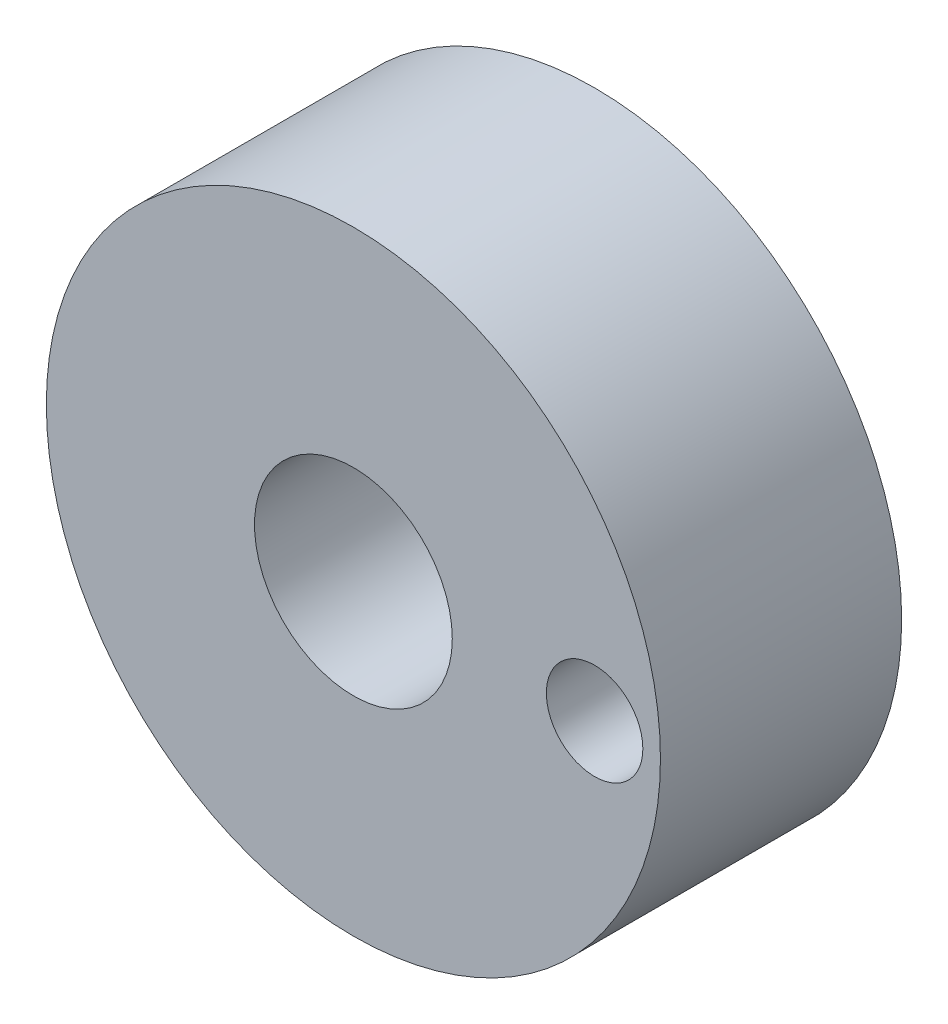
ISO-10303-21;
HEADER;
FILE_DESCRIPTION(('STEP AP214'),'2;1');
FILE_NAME('part.step','',(''),(''),'','','');
FILE_SCHEMA(('AUTOMOTIVE_DESIGN { 1 0 10303 214 1 1 1 1 }'));
ENDSEC;
DATA;
#1=APPLICATION_CONTEXT('core data for automotive mechanical design processes');
#2=APPLICATION_PROTOCOL_DEFINITION('international standard','automotive_design',2000,#1);
#3=PRODUCT_CONTEXT('',#1,'mechanical');
#4=PRODUCT('Part','Part','',(#3));
#5=PRODUCT_RELATED_PRODUCT_CATEGORY('part','',(#4));
#6=PRODUCT_DEFINITION_FORMATION('','',#4);
#7=PRODUCT_DEFINITION_CONTEXT('part definition',#1,'design');
#8=PRODUCT_DEFINITION('design','',#6,#7);
#9=PRODUCT_DEFINITION_SHAPE('','',#8);
#10=(LENGTH_UNIT() NAMED_UNIT(*) SI_UNIT(.MILLI.,.METRE.));
#11=(NAMED_UNIT(*) PLANE_ANGLE_UNIT() SI_UNIT($,.RADIAN.));
#12=(NAMED_UNIT(*) SI_UNIT($,.STERADIAN.) SOLID_ANGLE_UNIT());
#13=UNCERTAINTY_MEASURE_WITH_UNIT(LENGTH_MEASURE(1.E-05),#10,'distance_accuracy_value','');
#14=(GEOMETRIC_REPRESENTATION_CONTEXT(3) GLOBAL_UNCERTAINTY_ASSIGNED_CONTEXT((#13)) GLOBAL_UNIT_ASSIGNED_CONTEXT((#10,
#11,#12)) REPRESENTATION_CONTEXT('',''));
#15=CARTESIAN_POINT('',(0.,0.,0.));
#16=DIRECTION('',(0.,0.,1.));
#17=DIRECTION('',(1.,0.,0.));
#18=AXIS2_PLACEMENT_3D('',#15,#16,#17);
#19=CARTESIAN_POINT('',(0.,0.,5.));
#20=DIRECTION('',(0.,0.,-1.));
#21=DIRECTION('',(-1.,0.,0.));
#22=AXIS2_PLACEMENT_3D('',#19,#20,#21);
#23=CYLINDRICAL_SURFACE('',#22,6.365);
#24=CARTESIAN_POINT('',(0.,0.,5.));
#25=DIRECTION('',(0.,0.,1.));
#26=DIRECTION('',(1.,0.,0.));
#27=AXIS2_PLACEMENT_3D('',#24,#25,#26);
#28=CIRCLE('',#27,6.365);
#29=CARTESIAN_POINT('',(6.365,0.,5.));
#30=VERTEX_POINT('',#29);
#31=EDGE_CURVE('E10',#30,#30,#28,.T.);
#32=ORIENTED_EDGE('',*,*,#31,.F.);
#33=EDGE_LOOP('',(#32));
#34=FACE_BOUND('',#33,.T.);
#35=CARTESIAN_POINT('',(0.,0.,0.));
#36=DIRECTION('',(0.,0.,1.));
#37=DIRECTION('',(1.,0.,0.));
#38=AXIS2_PLACEMENT_3D('',#35,#36,#37);
#39=CIRCLE('',#38,6.365);
#40=CARTESIAN_POINT('',(6.365,0.,0.));
#41=VERTEX_POINT('',#40);
#42=EDGE_CURVE('E33',#41,#41,#39,.T.);
#43=ORIENTED_EDGE('',*,*,#42,.T.);
#44=EDGE_LOOP('',(#43));
#45=FACE_BOUND('',#44,.T.);
#46=ADVANCED_FACE('F30',(#34,#45),#23,.T.);
#47=CARTESIAN_POINT('',(0.,0.,5.));
#48=DIRECTION('',(0.,0.,1.));
#49=DIRECTION('',(1.,0.,0.));
#50=AXIS2_PLACEMENT_3D('',#47,#48,#49);
#51=PLANE('',#50);
#52=CARTESIAN_POINT('',(5.,0.,5.));
#53=DIRECTION('',(0.,0.,1.));
#54=DIRECTION('',(1.,0.,0.));
#55=AXIS2_PLACEMENT_3D('',#52,#53,#54);
#56=CIRCLE('',#55,1.);
#57=CARTESIAN_POINT('',(6.,0.,5.));
#58=VERTEX_POINT('',#57);
#59=EDGE_CURVE('E48',#58,#58,#56,.T.);
#60=ORIENTED_EDGE('',*,*,#59,.F.);
#61=EDGE_LOOP('',(#60));
#62=FACE_BOUND('',#61,.T.);
#63=CARTESIAN_POINT('',(0.,0.,5.));
#64=DIRECTION('',(0.,0.,1.));
#65=DIRECTION('',(1.,0.,0.));
#66=AXIS2_PLACEMENT_3D('',#63,#64,#65);
#67=CIRCLE('',#66,2.05);
#68=CARTESIAN_POINT('',(2.05,0.,5.));
#69=VERTEX_POINT('',#68);
#70=EDGE_CURVE('E42',#69,#69,#67,.T.);
#71=ORIENTED_EDGE('',*,*,#70,.F.);
#72=EDGE_LOOP('',(#71));
#73=FACE_BOUND('',#72,.T.);
#74=ORIENTED_EDGE('',*,*,#31,.T.);
#75=EDGE_LOOP('',(#74));
#76=FACE_BOUND('',#75,.T.);
#77=ADVANCED_FACE('F64',(#62,#73,#76),#51,.T.);
#78=CARTESIAN_POINT('',(0.,0.,0.));
#79=DIRECTION('',(0.,0.,1.));
#80=DIRECTION('',(1.,0.,0.));
#81=AXIS2_PLACEMENT_3D('',#78,#79,#80);
#82=PLANE('',#81);
#83=CARTESIAN_POINT('',(5.,0.,0.));
#84=DIRECTION('',(0.,0.,1.));
#85=DIRECTION('',(1.,0.,0.));
#86=AXIS2_PLACEMENT_3D('',#83,#84,#85);
#87=CIRCLE('',#86,1.);
#88=CARTESIAN_POINT('',(6.,0.,0.));
#89=VERTEX_POINT('',#88);
#90=EDGE_CURVE('E45',#89,#89,#87,.T.);
#91=ORIENTED_EDGE('',*,*,#90,.T.);
#92=EDGE_LOOP('',(#91));
#93=FACE_BOUND('',#92,.T.);
#94=CARTESIAN_POINT('',(0.,0.,0.));
#95=DIRECTION('',(0.,0.,1.));
#96=DIRECTION('',(1.,0.,0.));
#97=AXIS2_PLACEMENT_3D('',#94,#95,#96);
#98=CIRCLE('',#97,2.05);
#99=CARTESIAN_POINT('',(2.05,0.,0.));
#100=VERTEX_POINT('',#99);
#101=EDGE_CURVE('E40',#100,#100,#98,.T.);
#102=ORIENTED_EDGE('',*,*,#101,.T.);
#103=EDGE_LOOP('',(#102));
#104=FACE_BOUND('',#103,.T.);
#105=ORIENTED_EDGE('',*,*,#42,.F.);
#106=EDGE_LOOP('',(#105));
#107=FACE_BOUND('',#106,.T.);
#108=ADVANCED_FACE('F54',(#93,#104,#107),#82,.F.);
#109=CARTESIAN_POINT('',(0.,0.,0.));
#110=DIRECTION('',(0.,0.,1.));
#111=DIRECTION('',(1.,0.,0.));
#112=AXIS2_PLACEMENT_3D('',#109,#110,#111);
#113=CYLINDRICAL_SURFACE('',#112,2.05);
#114=ORIENTED_EDGE('',*,*,#101,.F.);
#115=EDGE_LOOP('',(#114));
#116=FACE_BOUND('',#115,.T.);
#117=ORIENTED_EDGE('',*,*,#70,.T.);
#118=EDGE_LOOP('',(#117));
#119=FACE_BOUND('',#118,.T.);
#120=ADVANCED_FACE('F60',(#116,#119),#113,.F.);
#121=CARTESIAN_POINT('',(5.,0.,0.));
#122=DIRECTION('',(0.,0.,1.));
#123=DIRECTION('',(1.,0.,0.));
#124=AXIS2_PLACEMENT_3D('',#121,#122,#123);
#125=CYLINDRICAL_SURFACE('',#124,1.);
#126=ORIENTED_EDGE('',*,*,#90,.F.);
#127=EDGE_LOOP('',(#126));
#128=FACE_BOUND('',#127,.T.);
#129=ORIENTED_EDGE('',*,*,#59,.T.);
#130=EDGE_LOOP('',(#129));
#131=FACE_BOUND('',#130,.T.);
#132=ADVANCED_FACE('F57',(#128,#131),#125,.F.);
#133=CLOSED_SHELL('',(#46,#77,#108,#120,#132));
#134=MANIFOLD_SOLID_BREP('B2',#133);
#135=ADVANCED_BREP_SHAPE_REPRESENTATION('',(#18,#134),#14);
#136=SHAPE_DEFINITION_REPRESENTATION(#9,#135);
ENDSEC;
END-ISO-10303-21;
